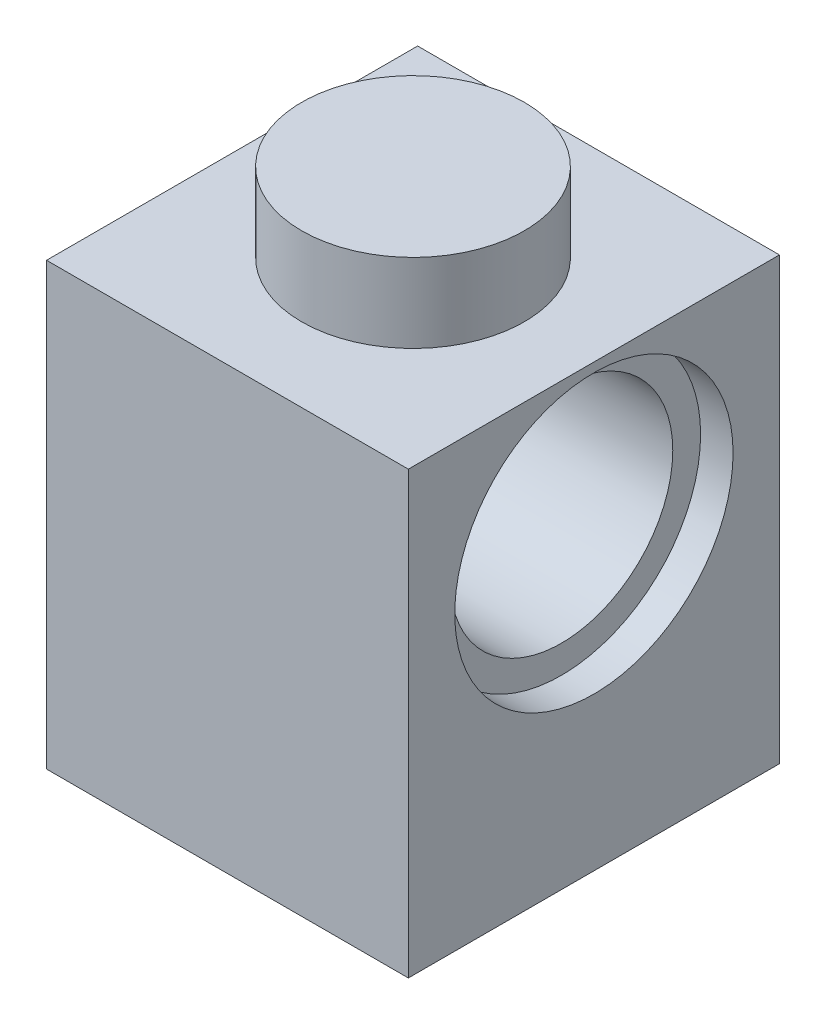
from build123d import *

# Parameters (mm, degrees)
SKETCH1_W          = 7.8
SKETCH1_H          = 8
EXTRUDE1_DEPTH     = 9.5
SKETCH6_W          = 4.9
SKETCH6_H          = 5.1
EXTRUDE8_DEPTH     = 2
SKETCH7_R          = 2.4
EXTRUDE10_DEPTH    = 1.7
SKETCH8_R          = 3
CUT_EXTRUDE1_DEPTH = 0.7
CUT_EXTRUDE2_START = -0.7
SKETCH9_R          = 3
CUT_EXTRUDE2_DEPTH = 0.7
SKETCH10_R         = 2.4
CUT_EXTRUDE3_DEPTH = 15.222517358


with BuildPart() as part:
    # Sketch1 → Extrude1 (new body)
    with BuildSketch(Plane(origin=(0, 0, 0), x_dir=(1, 0, 0), z_dir=(0, 1, 0))):
        Rectangle(SKETCH1_W, SKETCH1_H)
    extrude(amount=EXTRUDE1_DEPTH)

    # Sketch6 → Extrude8 (cut)
    with BuildSketch(Plane.XZ):
        Rectangle(SKETCH6_W, SKETCH6_H)
    extrude(amount=-EXTRUDE8_DEPTH, mode=Mode.SUBTRACT)

    # Sketch7 → Extrude10 (add)
    with BuildSketch(Plane(origin=(0, 9.5, 0), x_dir=(1, 0, 0), z_dir=(0, 1, 0))):
        with Locations(Location((0, 0, 0), (0, 0, 270))):
            Circle(SKETCH7_R)
    extrude(amount=EXTRUDE10_DEPTH)

    # Sketch8 → Cut-Extrude1 (cut)
    with BuildSketch(Plane(origin=(3.9, 0, 0), x_dir=(0, 0, -1), z_dir=(1, 0, 0))):
        with Locations((0, 6.3)):
            Circle(SKETCH8_R)
    extrude(amount=-CUT_EXTRUDE1_DEPTH, mode=Mode.SUBTRACT)

    # Sketch9 → Cut-Extrude2 (cut)
    with BuildSketch(Plane.ZY.offset(3.9).offset(CUT_EXTRUDE2_START)):
        with Locations(Location((0, 6.3, 0), (0, 0, 180))):
            Circle(SKETCH9_R)
    extrude(amount=CUT_EXTRUDE2_DEPTH, mode=Mode.SUBTRACT)

    # Sketch10 → Cut-Extrude3 (cut, through all)
    with BuildSketch(Plane.ZY.offset(3.9)):
        with Locations((0, 6.3)):
            Circle(SKETCH10_R)
    extrude(amount=-CUT_EXTRUDE3_DEPTH, mode=Mode.SUBTRACT)


solid = part.part
